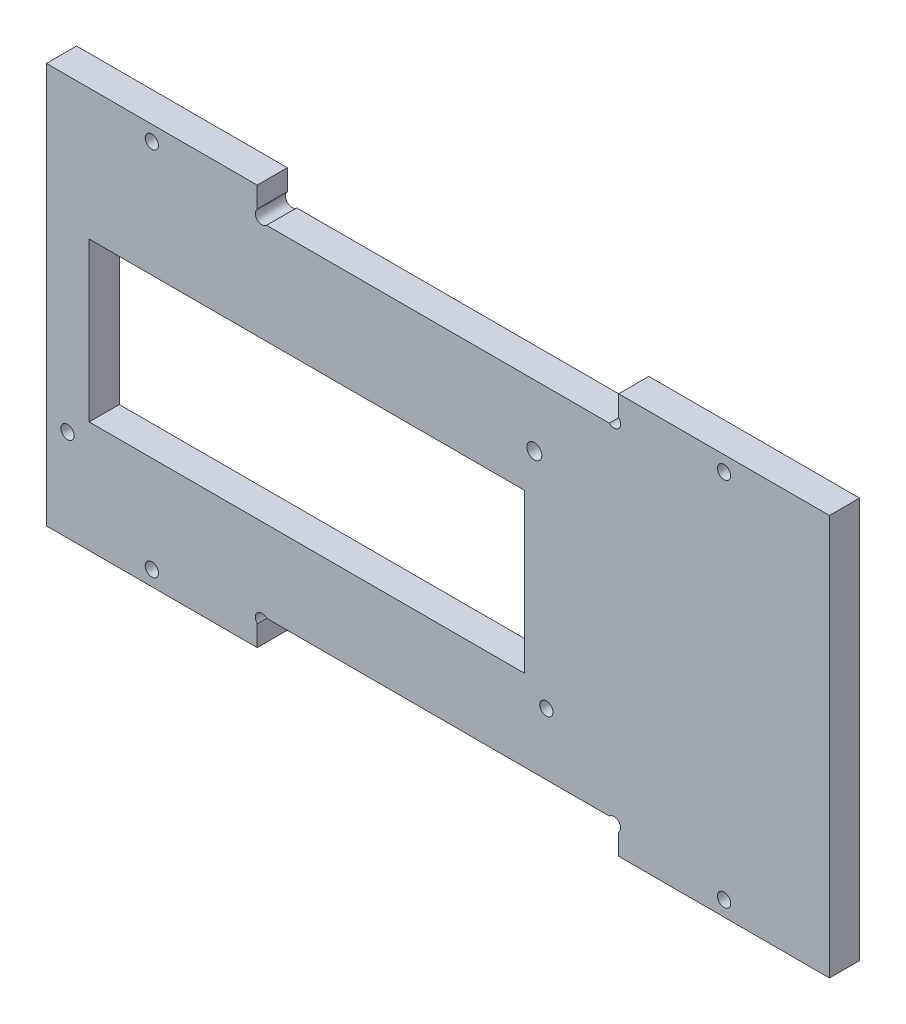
ISO-10303-21;
HEADER;
FILE_DESCRIPTION(('STEP AP214'),'2;1');
FILE_NAME('part.step','',(''),(''),'','','');
FILE_SCHEMA(('AUTOMOTIVE_DESIGN { 1 0 10303 214 1 1 1 1 }'));
ENDSEC;
DATA;
#1=APPLICATION_CONTEXT('core data for automotive mechanical design processes');
#2=APPLICATION_PROTOCOL_DEFINITION('international standard','automotive_design',2000,#1);
#3=PRODUCT_CONTEXT('',#1,'mechanical');
#4=PRODUCT('Part','Part','',(#3));
#5=PRODUCT_RELATED_PRODUCT_CATEGORY('part','',(#4));
#6=PRODUCT_DEFINITION_FORMATION('','',#4);
#7=PRODUCT_DEFINITION_CONTEXT('part definition',#1,'design');
#8=PRODUCT_DEFINITION('design','',#6,#7);
#9=PRODUCT_DEFINITION_SHAPE('','',#8);
#10=(LENGTH_UNIT() NAMED_UNIT(*) SI_UNIT(.MILLI.,.METRE.));
#11=(NAMED_UNIT(*) PLANE_ANGLE_UNIT() SI_UNIT($,.RADIAN.));
#12=(NAMED_UNIT(*) SI_UNIT($,.STERADIAN.) SOLID_ANGLE_UNIT());
#13=UNCERTAINTY_MEASURE_WITH_UNIT(LENGTH_MEASURE(1.E-05),#10,'distance_accuracy_value','');
#14=(GEOMETRIC_REPRESENTATION_CONTEXT(3) GLOBAL_UNCERTAINTY_ASSIGNED_CONTEXT((#13)) GLOBAL_UNIT_ASSIGNED_CONTEXT((#10,
#11,#12)) REPRESENTATION_CONTEXT('',''));
#15=CARTESIAN_POINT('',(0.,0.,0.));
#16=DIRECTION('',(0.,0.,1.));
#17=DIRECTION('',(1.,0.,0.));
#18=AXIS2_PLACEMENT_3D('',#15,#16,#17);
#19=CARTESIAN_POINT('',(0.,66.5,5.));
#20=DIRECTION('',(0.,0.,-1.));
#21=DIRECTION('',(-1.,0.,0.));
#22=AXIS2_PLACEMENT_3D('',#19,#20,#21);
#23=PLANE('',#22);
#24=CARTESIAN_POINT('',(112.5,2.5,5.));
#25=DIRECTION('',(0.,0.,-1.));
#26=DIRECTION('',(-1.,0.,0.));
#27=AXIS2_PLACEMENT_3D('',#24,#25,#26);
#28=CIRCLE('',#27,1.1);
#29=CARTESIAN_POINT('',(111.4,2.5,5.));
#30=VERTEX_POINT('',#29);
#31=EDGE_CURVE('E242',#30,#30,#28,.T.);
#32=ORIENTED_EDGE('',*,*,#31,.T.);
#33=EDGE_LOOP('',(#32));
#34=FACE_BOUND('',#33,.T.);
#35=CARTESIAN_POINT('',(17.5,2.5,5.));
#36=DIRECTION('',(0.,0.,1.));
#37=DIRECTION('',(1.,0.,0.));
#38=AXIS2_PLACEMENT_3D('',#35,#36,#37);
#39=CIRCLE('',#38,1.1);
#40=CARTESIAN_POINT('',(18.6,2.5,5.));
#41=VERTEX_POINT('',#40);
#42=EDGE_CURVE('E251',#41,#41,#39,.T.);
#43=ORIENTED_EDGE('',*,*,#42,.F.);
#44=EDGE_LOOP('',(#43));
#45=FACE_BOUND('',#44,.T.);
#46=DIRECTION('',(-1.,0.,0.));
#47=VECTOR('',#46,1.);
#48=CARTESIAN_POINT('',(79.4,44.8,5.));
#49=LINE('',#48,#47);
#50=CARTESIAN_POINT('',(79.4,44.8,5.));
#51=VERTEX_POINT('',#50);
#52=CARTESIAN_POINT('',(7.09999999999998,44.8,5.));
#53=VERTEX_POINT('',#52);
#54=EDGE_CURVE('E344',#51,#53,#49,.T.);
#55=ORIENTED_EDGE('',*,*,#54,.F.);
#56=DIRECTION('',(0.,1.,0.));
#57=VECTOR('',#56,1.);
#58=CARTESIAN_POINT('',(79.4,18.5,5.));
#59=LINE('',#58,#57);
#60=CARTESIAN_POINT('',(79.4,18.5,5.));
#61=VERTEX_POINT('',#60);
#62=EDGE_CURVE('E342',#61,#51,#59,.T.);
#63=ORIENTED_EDGE('',*,*,#62,.F.);
#64=DIRECTION('',(1.,0.,0.));
#65=VECTOR('',#64,1.);
#66=CARTESIAN_POINT('',(79.4,18.5,5.));
#67=LINE('',#66,#65);
#68=CARTESIAN_POINT('',(7.09999999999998,18.5,5.));
#69=VERTEX_POINT('',#68);
#70=EDGE_CURVE('E350',#69,#61,#67,.T.);
#71=ORIENTED_EDGE('',*,*,#70,.F.);
#72=DIRECTION('',(0.,-1.,0.));
#73=VECTOR('',#72,1.);
#74=CARTESIAN_POINT('',(7.09999999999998,18.5,5.));
#75=LINE('',#74,#73);
#76=EDGE_CURVE('E347',#53,#69,#75,.T.);
#77=ORIENTED_EDGE('',*,*,#76,.F.);
#78=EDGE_LOOP('',(#55,#63,#71,#77));
#79=FACE_BOUND('',#78,.T.);
#80=CARTESIAN_POINT('',(3.5,15.25,5.));
#81=DIRECTION('',(0.,0.,1.));
#82=DIRECTION('',(1.,0.,0.));
#83=AXIS2_PLACEMENT_3D('',#80,#81,#82);
#84=CIRCLE('',#83,1.1);
#85=CARTESIAN_POINT('',(4.6,15.25,5.));
#86=VERTEX_POINT('',#85);
#87=EDGE_CURVE('E366',#86,#86,#84,.T.);
#88=ORIENTED_EDGE('',*,*,#87,.F.);
#89=EDGE_LOOP('',(#88));
#90=FACE_BOUND('',#89,.T.);
#91=CARTESIAN_POINT('',(83.,15.25,5.));
#92=DIRECTION('',(0.,0.,1.));
#93=DIRECTION('',(1.,0.,0.));
#94=AXIS2_PLACEMENT_3D('',#91,#92,#93);
#95=CIRCLE('',#94,1.10000000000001);
#96=CARTESIAN_POINT('',(84.1,15.25,5.));
#97=VERTEX_POINT('',#96);
#98=EDGE_CURVE('E372',#97,#97,#95,.T.);
#99=ORIENTED_EDGE('',*,*,#98,.F.);
#100=EDGE_LOOP('',(#99));
#101=FACE_BOUND('',#100,.T.);
#102=CARTESIAN_POINT('',(81.,51.25,5.));
#103=DIRECTION('',(0.,0.,1.));
#104=DIRECTION('',(1.,0.,0.));
#105=AXIS2_PLACEMENT_3D('',#102,#103,#104);
#106=CIRCLE('',#105,1.25);
#107=CARTESIAN_POINT('',(82.25,51.25,5.));
#108=VERTEX_POINT('',#107);
#109=EDGE_CURVE('E378',#108,#108,#106,.T.);
#110=ORIENTED_EDGE('',*,*,#109,.F.);
#111=EDGE_LOOP('',(#110));
#112=FACE_BOUND('',#111,.T.);
#113=DIRECTION('',(0.,1.,0.));
#114=VECTOR('',#113,1.);
#115=CARTESIAN_POINT('',(95.,66.5,5.));
#116=LINE('',#115,#114);
#117=CARTESIAN_POINT('',(95.,63.0556349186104,5.));
#118=VERTEX_POINT('',#117);
#119=CARTESIAN_POINT('',(95.,66.5,5.));
#120=VERTEX_POINT('',#119);
#121=EDGE_CURVE('E300',#118,#120,#116,.T.);
#122=ORIENTED_EDGE('',*,*,#121,.F.);
#123=CARTESIAN_POINT('',(94.2221825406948,62.2778174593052,5.));
#124=DIRECTION('',(0.,0.,1.));
#125=DIRECTION('',(1.,0.,0.));
#126=AXIS2_PLACEMENT_3D('',#123,#124,#125);
#127=CIRCLE('',#126,1.10000000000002);
#128=CARTESIAN_POINT('',(93.4443650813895,61.5,5.));
#129=VERTEX_POINT('',#128);
#130=EDGE_CURVE('E271',#129,#118,#127,.T.);
#131=ORIENTED_EDGE('',*,*,#130,.F.);
#132=DIRECTION('',(1.,0.,0.));
#133=VECTOR('',#132,1.);
#134=CARTESIAN_POINT('',(95.,61.5,5.));
#135=LINE('',#134,#133);
#136=CARTESIAN_POINT('',(36.5556349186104,61.5,5.));
#137=VERTEX_POINT('',#136);
#138=EDGE_CURVE('E305',#137,#129,#135,.T.);
#139=ORIENTED_EDGE('',*,*,#138,.F.);
#140=CARTESIAN_POINT('',(35.7778174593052,62.2778174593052,5.));
#141=DIRECTION('',(0.,0.,1.));
#142=DIRECTION('',(1.,0.,0.));
#143=AXIS2_PLACEMENT_3D('',#140,#141,#142);
#144=CIRCLE('',#143,1.1);
#145=CARTESIAN_POINT('',(35.,63.0556349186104,5.));
#146=VERTEX_POINT('',#145);
#147=EDGE_CURVE('E277',#146,#137,#144,.T.);
#148=ORIENTED_EDGE('',*,*,#147,.F.);
#149=DIRECTION('',(0.,-1.,0.));
#150=VECTOR('',#149,1.);
#151=CARTESIAN_POINT('',(35.,66.5,5.));
#152=LINE('',#151,#150);
#153=CARTESIAN_POINT('',(35.,66.5,5.));
#154=VERTEX_POINT('',#153);
#155=EDGE_CURVE('E302',#154,#146,#152,.T.);
#156=ORIENTED_EDGE('',*,*,#155,.F.);
#157=DIRECTION('',(-1.,0.,0.));
#158=VECTOR('',#157,1.);
#159=CARTESIAN_POINT('',(0.,66.5,5.));
#160=LINE('',#159,#158);
#161=CARTESIAN_POINT('',(0.,66.5,5.));
#162=VERTEX_POINT('',#161);
#163=EDGE_CURVE('E394',#154,#162,#160,.T.);
#164=ORIENTED_EDGE('',*,*,#163,.T.);
#165=DIRECTION('',(0.,-1.,0.));
#166=VECTOR('',#165,1.);
#167=CARTESIAN_POINT('',(0.,0.,5.));
#168=LINE('',#167,#166);
#169=CARTESIAN_POINT('',(0.,0.,5.));
#170=VERTEX_POINT('',#169);
#171=EDGE_CURVE('E384',#162,#170,#168,.T.);
#172=ORIENTED_EDGE('',*,*,#171,.T.);
#173=DIRECTION('',(1.,0.,0.));
#174=VECTOR('',#173,1.);
#175=CARTESIAN_POINT('',(0.,0.,5.));
#176=LINE('',#175,#174);
#177=CARTESIAN_POINT('',(35.,0.,5.));
#178=VERTEX_POINT('',#177);
#179=EDGE_CURVE('E389',#170,#178,#176,.T.);
#180=ORIENTED_EDGE('',*,*,#179,.T.);
#181=DIRECTION('',(0.,-1.,0.));
#182=VECTOR('',#181,1.);
#183=CARTESIAN_POINT('',(35.,0.,5.));
#184=LINE('',#183,#182);
#185=CARTESIAN_POINT('',(35.,3.4443650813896,5.));
#186=VERTEX_POINT('',#185);
#187=EDGE_CURVE('E323',#186,#178,#184,.T.);
#188=ORIENTED_EDGE('',*,*,#187,.F.);
#189=CARTESIAN_POINT('',(35.7778174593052,4.2221825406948,5.));
#190=DIRECTION('',(0.,0.,1.));
#191=DIRECTION('',(1.,0.,0.));
#192=AXIS2_PLACEMENT_3D('',#189,#190,#191);
#193=CIRCLE('',#192,1.1);
#194=CARTESIAN_POINT('',(36.5556349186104,4.99999999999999,5.));
#195=VERTEX_POINT('',#194);
#196=EDGE_CURVE('E283',#195,#186,#193,.T.);
#197=ORIENTED_EDGE('',*,*,#196,.F.);
#198=DIRECTION('',(-1.,0.,0.));
#199=VECTOR('',#198,1.);
#200=CARTESIAN_POINT('',(95.,5.,5.));
#201=LINE('',#200,#199);
#202=CARTESIAN_POINT('',(93.4443650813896,5.,5.));
#203=VERTEX_POINT('',#202);
#204=EDGE_CURVE('E320',#203,#195,#201,.T.);
#205=ORIENTED_EDGE('',*,*,#204,.F.);
#206=CARTESIAN_POINT('',(94.2221825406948,4.2221825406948,5.));
#207=DIRECTION('',(0.,0.,1.));
#208=DIRECTION('',(1.,0.,0.));
#209=AXIS2_PLACEMENT_3D('',#206,#207,#208);
#210=CIRCLE('',#209,1.10000000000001);
#211=CARTESIAN_POINT('',(95.,3.44436508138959,5.));
#212=VERTEX_POINT('',#211);
#213=EDGE_CURVE('E289',#212,#203,#210,.T.);
#214=ORIENTED_EDGE('',*,*,#213,.F.);
#215=DIRECTION('',(0.,1.,0.));
#216=VECTOR('',#215,1.);
#217=CARTESIAN_POINT('',(95.,0.,5.));
#218=LINE('',#217,#216);
#219=CARTESIAN_POINT('',(95.,0.,5.));
#220=VERTEX_POINT('',#219);
#221=EDGE_CURVE('E317',#220,#212,#218,.T.);
#222=ORIENTED_EDGE('',*,*,#221,.F.);
#223=CARTESIAN_POINT('',(130.,0.,5.));
#224=VERTEX_POINT('',#223);
#225=EDGE_CURVE('E387',#220,#224,#176,.T.);
#226=ORIENTED_EDGE('',*,*,#225,.T.);
#227=DIRECTION('',(0.,1.,0.));
#228=VECTOR('',#227,1.);
#229=CARTESIAN_POINT('',(130.,0.,5.));
#230=LINE('',#229,#228);
#231=CARTESIAN_POINT('',(130.,66.5,5.));
#232=VERTEX_POINT('',#231);
#233=EDGE_CURVE('E392',#224,#232,#230,.T.);
#234=ORIENTED_EDGE('',*,*,#233,.T.);
#235=EDGE_CURVE('E395',#232,#120,#160,.T.);
#236=ORIENTED_EDGE('',*,*,#235,.T.);
#237=EDGE_LOOP('',(#122,#131,#139,#148,#156,#164,#172,#180,#188,#197,#205,#214,#222,#226,#234,#236));
#238=FACE_BOUND('',#237,.T.);
#239=CARTESIAN_POINT('',(112.5,64.,5.));
#240=DIRECTION('',(0.,0.,1.));
#241=DIRECTION('',(-1.,0.,0.));
#242=AXIS2_PLACEMENT_3D('',#239,#240,#241);
#243=CIRCLE('',#242,1.1);
#244=CARTESIAN_POINT('',(111.4,64.,5.));
#245=VERTEX_POINT('',#244);
#246=EDGE_CURVE('E239',#245,#245,#243,.T.);
#247=ORIENTED_EDGE('',*,*,#246,.F.);
#248=EDGE_LOOP('',(#247));
#249=FACE_BOUND('',#248,.T.);
#250=CARTESIAN_POINT('',(17.5,64.,5.));
#251=DIRECTION('',(0.,0.,-1.));
#252=DIRECTION('',(1.,0.,0.));
#253=AXIS2_PLACEMENT_3D('',#250,#251,#252);
#254=CIRCLE('',#253,1.1);
#255=CARTESIAN_POINT('',(18.6,64.,5.));
#256=VERTEX_POINT('',#255);
#257=EDGE_CURVE('E229',#256,#256,#254,.T.);
#258=ORIENTED_EDGE('',*,*,#257,.T.);
#259=EDGE_LOOP('',(#258));
#260=FACE_BOUND('',#259,.T.);
#261=ADVANCED_FACE('F33',(#34,#45,#79,#90,#101,#112,#238,#249,#260),#23,.F.);
#262=CARTESIAN_POINT('',(0.,66.5,0.));
#263=DIRECTION('',(0.,0.,-1.));
#264=DIRECTION('',(-1.,0.,0.));
#265=AXIS2_PLACEMENT_3D('',#262,#263,#264);
#266=PLANE('',#265);
#267=DIRECTION('',(0.,-1.,0.));
#268=VECTOR('',#267,1.);
#269=CARTESIAN_POINT('',(78.4,48.3,0.));
#270=LINE('',#269,#268);
#271=CARTESIAN_POINT('',(78.4,54.8,0.));
#272=VERTEX_POINT('',#271);
#273=CARTESIAN_POINT('',(78.4,48.3,0.));
#274=VERTEX_POINT('',#273);
#275=EDGE_CURVE('E48',#272,#274,#270,.T.);
#276=ORIENTED_EDGE('',*,*,#275,.F.);
#277=DIRECTION('',(1.,0.,0.));
#278=VECTOR('',#277,1.);
#279=CARTESIAN_POINT('',(78.4,54.8,0.));
#280=LINE('',#279,#278);
#281=CARTESIAN_POINT('',(38.4,54.8,0.));
#282=VERTEX_POINT('',#281);
#283=EDGE_CURVE('E214',#282,#272,#280,.T.);
#284=ORIENTED_EDGE('',*,*,#283,.F.);
#285=DIRECTION('',(0.,1.,0.));
#286=VECTOR('',#285,1.);
#287=CARTESIAN_POINT('',(38.4,48.3,0.));
#288=LINE('',#287,#286);
#289=CARTESIAN_POINT('',(38.4,48.3,0.));
#290=VERTEX_POINT('',#289);
#291=EDGE_CURVE('E217',#290,#282,#288,.T.);
#292=ORIENTED_EDGE('',*,*,#291,.F.);
#293=DIRECTION('',(-1.,0.,0.));
#294=VECTOR('',#293,1.);
#295=CARTESIAN_POINT('',(78.4,48.3,0.));
#296=LINE('',#295,#294);
#297=EDGE_CURVE('E223',#274,#290,#296,.T.);
#298=ORIENTED_EDGE('',*,*,#297,.F.);
#299=EDGE_LOOP('',(#276,#284,#292,#298));
#300=FACE_BOUND('',#299,.T.);
#301=CARTESIAN_POINT('',(112.5,2.5,0.));
#302=DIRECTION('',(0.,0.,-1.));
#303=DIRECTION('',(-1.,0.,0.));
#304=AXIS2_PLACEMENT_3D('',#301,#302,#303);
#305=CIRCLE('',#304,1.1);
#306=CARTESIAN_POINT('',(111.4,2.5,0.));
#307=VERTEX_POINT('',#306);
#308=EDGE_CURVE('E247',#307,#307,#305,.T.);
#309=ORIENTED_EDGE('',*,*,#308,.F.);
#310=EDGE_LOOP('',(#309));
#311=FACE_BOUND('',#310,.T.);
#312=CARTESIAN_POINT('',(17.5,2.5,0.));
#313=DIRECTION('',(0.,0.,-1.));
#314=DIRECTION('',(-1.,0.,0.));
#315=AXIS2_PLACEMENT_3D('',#312,#313,#314);
#316=CIRCLE('',#315,1.1);
#317=CARTESIAN_POINT('',(16.4,2.5,0.));
#318=VERTEX_POINT('',#317);
#319=EDGE_CURVE('E250',#318,#318,#316,.F.);
#320=ORIENTED_EDGE('',*,*,#319,.T.);
#321=EDGE_LOOP('',(#320));
#322=FACE_BOUND('',#321,.T.);
#323=CARTESIAN_POINT('',(94.2221825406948,62.2778174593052,0.));
#324=DIRECTION('',(0.,0.,-1.));
#325=DIRECTION('',(-1.,0.,0.));
#326=AXIS2_PLACEMENT_3D('',#323,#324,#325);
#327=CIRCLE('',#326,1.10000000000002);
#328=CARTESIAN_POINT('',(93.4443650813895,61.5,0.));
#329=VERTEX_POINT('',#328);
#330=CARTESIAN_POINT('',(95.,63.0556349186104,0.));
#331=VERTEX_POINT('',#330);
#332=EDGE_CURVE('E273',#329,#331,#327,.F.);
#333=ORIENTED_EDGE('',*,*,#332,.T.);
#334=DIRECTION('',(0.,1.,0.));
#335=VECTOR('',#334,1.);
#336=CARTESIAN_POINT('',(95.,66.5,0.));
#337=LINE('',#336,#335);
#338=CARTESIAN_POINT('',(95.,66.5,0.));
#339=VERTEX_POINT('',#338);
#340=EDGE_CURVE('E298',#331,#339,#337,.T.);
#341=ORIENTED_EDGE('',*,*,#340,.T.);
#342=DIRECTION('',(-1.,0.,0.));
#343=VECTOR('',#342,1.);
#344=CARTESIAN_POINT('',(0.,66.5,0.));
#345=LINE('',#344,#343);
#346=CARTESIAN_POINT('',(130.,66.5,0.));
#347=VERTEX_POINT('',#346);
#348=EDGE_CURVE('E388',#347,#339,#345,.T.);
#349=ORIENTED_EDGE('',*,*,#348,.F.);
#350=DIRECTION('',(0.,1.,0.));
#351=VECTOR('',#350,1.);
#352=CARTESIAN_POINT('',(130.,0.,0.));
#353=LINE('',#352,#351);
#354=CARTESIAN_POINT('',(130.,0.,0.));
#355=VERTEX_POINT('',#354);
#356=EDGE_CURVE('E405',#355,#347,#353,.T.);
#357=ORIENTED_EDGE('',*,*,#356,.F.);
#358=DIRECTION('',(1.,0.,0.));
#359=VECTOR('',#358,1.);
#360=CARTESIAN_POINT('',(0.,0.,0.));
#361=LINE('',#360,#359);
#362=CARTESIAN_POINT('',(95.,0.,0.));
#363=VERTEX_POINT('',#362);
#364=EDGE_CURVE('E401',#363,#355,#361,.T.);
#365=ORIENTED_EDGE('',*,*,#364,.F.);
#366=DIRECTION('',(0.,1.,0.));
#367=VECTOR('',#366,1.);
#368=CARTESIAN_POINT('',(95.,0.,0.));
#369=LINE('',#368,#367);
#370=CARTESIAN_POINT('',(95.,3.44436508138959,0.));
#371=VERTEX_POINT('',#370);
#372=EDGE_CURVE('E314',#363,#371,#369,.T.);
#373=ORIENTED_EDGE('',*,*,#372,.T.);
#374=CARTESIAN_POINT('',(94.2221825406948,4.2221825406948,0.));
#375=DIRECTION('',(0.,0.,-1.));
#376=DIRECTION('',(-1.,0.,0.));
#377=AXIS2_PLACEMENT_3D('',#374,#375,#376);
#378=CIRCLE('',#377,1.10000000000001);
#379=CARTESIAN_POINT('',(93.4443650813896,5.,0.));
#380=VERTEX_POINT('',#379);
#381=EDGE_CURVE('E291',#371,#380,#378,.F.);
#382=ORIENTED_EDGE('',*,*,#381,.T.);
#383=DIRECTION('',(-1.,0.,0.));
#384=VECTOR('',#383,1.);
#385=CARTESIAN_POINT('',(95.,5.,0.));
#386=LINE('',#385,#384);
#387=CARTESIAN_POINT('',(36.5556349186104,4.99999999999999,0.));
#388=VERTEX_POINT('',#387);
#389=EDGE_CURVE('E328',#380,#388,#386,.T.);
#390=ORIENTED_EDGE('',*,*,#389,.T.);
#391=CARTESIAN_POINT('',(35.7778174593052,4.2221825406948,0.));
#392=DIRECTION('',(0.,0.,-1.));
#393=DIRECTION('',(-1.,0.,0.));
#394=AXIS2_PLACEMENT_3D('',#391,#392,#393);
#395=CIRCLE('',#394,1.1);
#396=CARTESIAN_POINT('',(35.,3.4443650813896,0.));
#397=VERTEX_POINT('',#396);
#398=EDGE_CURVE('E285',#388,#397,#395,.F.);
#399=ORIENTED_EDGE('',*,*,#398,.T.);
#400=DIRECTION('',(0.,-1.,0.));
#401=VECTOR('',#400,1.);
#402=CARTESIAN_POINT('',(35.,0.,0.));
#403=LINE('',#402,#401);
#404=CARTESIAN_POINT('',(35.,0.,0.));
#405=VERTEX_POINT('',#404);
#406=EDGE_CURVE('E310',#397,#405,#403,.T.);
#407=ORIENTED_EDGE('',*,*,#406,.T.);
#408=CARTESIAN_POINT('',(0.,0.,0.));
#409=VERTEX_POINT('',#408);
#410=EDGE_CURVE('E402',#409,#405,#361,.T.);
#411=ORIENTED_EDGE('',*,*,#410,.F.);
#412=DIRECTION('',(0.,-1.,0.));
#413=VECTOR('',#412,1.);
#414=CARTESIAN_POINT('',(0.,0.,0.));
#415=LINE('',#414,#413);
#416=CARTESIAN_POINT('',(0.,66.5,0.));
#417=VERTEX_POINT('',#416);
#418=EDGE_CURVE('E381',#417,#409,#415,.T.);
#419=ORIENTED_EDGE('',*,*,#418,.F.);
#420=CARTESIAN_POINT('',(35.,66.5,0.));
#421=VERTEX_POINT('',#420);
#422=EDGE_CURVE('E407',#421,#417,#345,.T.);
#423=ORIENTED_EDGE('',*,*,#422,.F.);
#424=DIRECTION('',(0.,-1.,0.));
#425=VECTOR('',#424,1.);
#426=CARTESIAN_POINT('',(35.,66.5,0.));
#427=LINE('',#426,#425);
#428=CARTESIAN_POINT('',(35.,63.0556349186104,0.));
#429=VERTEX_POINT('',#428);
#430=EDGE_CURVE('E294',#421,#429,#427,.T.);
#431=ORIENTED_EDGE('',*,*,#430,.T.);
#432=CARTESIAN_POINT('',(35.7778174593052,62.2778174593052,0.));
#433=DIRECTION('',(0.,0.,-1.));
#434=DIRECTION('',(-1.,0.,0.));
#435=AXIS2_PLACEMENT_3D('',#432,#433,#434);
#436=CIRCLE('',#435,1.1);
#437=CARTESIAN_POINT('',(36.5556349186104,61.5,0.));
#438=VERTEX_POINT('',#437);
#439=EDGE_CURVE('E279',#429,#438,#436,.F.);
#440=ORIENTED_EDGE('',*,*,#439,.T.);
#441=DIRECTION('',(1.,0.,0.));
#442=VECTOR('',#441,1.);
#443=CARTESIAN_POINT('',(95.,61.5,0.));
#444=LINE('',#443,#442);
#445=EDGE_CURVE('E56',#438,#329,#444,.T.);
#446=ORIENTED_EDGE('',*,*,#445,.T.);
#447=EDGE_LOOP('',(#333,#341,#349,#357,#365,#373,#382,#390,#399,#407,#411,#419,#423,#431,#440,#446));
#448=FACE_BOUND('',#447,.T.);
#449=DIRECTION('',(0.,1.,0.));
#450=VECTOR('',#449,1.);
#451=CARTESIAN_POINT('',(79.4,18.5,0.));
#452=LINE('',#451,#450);
#453=CARTESIAN_POINT('',(79.4,18.5,0.));
#454=VERTEX_POINT('',#453);
#455=CARTESIAN_POINT('',(79.4,44.8,0.));
#456=VERTEX_POINT('',#455);
#457=EDGE_CURVE('E339',#454,#456,#452,.T.);
#458=ORIENTED_EDGE('',*,*,#457,.T.);
#459=DIRECTION('',(-1.,0.,0.));
#460=VECTOR('',#459,1.);
#461=CARTESIAN_POINT('',(79.4,44.8,0.));
#462=LINE('',#461,#460);
#463=CARTESIAN_POINT('',(7.09999999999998,44.8,0.));
#464=VERTEX_POINT('',#463);
#465=EDGE_CURVE('E356',#456,#464,#462,.T.);
#466=ORIENTED_EDGE('',*,*,#465,.T.);
#467=DIRECTION('',(0.,-1.,0.));
#468=VECTOR('',#467,1.);
#469=CARTESIAN_POINT('',(7.09999999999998,18.5,0.));
#470=LINE('',#469,#468);
#471=CARTESIAN_POINT('',(7.09999999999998,18.5,0.));
#472=VERTEX_POINT('',#471);
#473=EDGE_CURVE('E333',#464,#472,#470,.T.);
#474=ORIENTED_EDGE('',*,*,#473,.T.);
#475=DIRECTION('',(1.,0.,0.));
#476=VECTOR('',#475,1.);
#477=CARTESIAN_POINT('',(79.4,18.5,0.));
#478=LINE('',#477,#476);
#479=EDGE_CURVE('E336',#472,#454,#478,.T.);
#480=ORIENTED_EDGE('',*,*,#479,.T.);
#481=EDGE_LOOP('',(#458,#466,#474,#480));
#482=FACE_BOUND('',#481,.T.);
#483=CARTESIAN_POINT('',(3.5,15.25,0.));
#484=DIRECTION('',(0.,0.,-1.));
#485=DIRECTION('',(-1.,0.,0.));
#486=AXIS2_PLACEMENT_3D('',#483,#484,#485);
#487=CIRCLE('',#486,1.1);
#488=CARTESIAN_POINT('',(2.4,15.25,0.));
#489=VERTEX_POINT('',#488);
#490=EDGE_CURVE('E365',#489,#489,#487,.F.);
#491=ORIENTED_EDGE('',*,*,#490,.T.);
#492=EDGE_LOOP('',(#491));
#493=FACE_BOUND('',#492,.T.);
#494=CARTESIAN_POINT('',(83.,15.25,0.));
#495=DIRECTION('',(0.,0.,-1.));
#496=DIRECTION('',(-1.,0.,0.));
#497=AXIS2_PLACEMENT_3D('',#494,#495,#496);
#498=CIRCLE('',#497,1.10000000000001);
#499=CARTESIAN_POINT('',(81.9,15.25,0.));
#500=VERTEX_POINT('',#499);
#501=EDGE_CURVE('E369',#500,#500,#498,.F.);
#502=ORIENTED_EDGE('',*,*,#501,.T.);
#503=EDGE_LOOP('',(#502));
#504=FACE_BOUND('',#503,.T.);
#505=CARTESIAN_POINT('',(81.,51.25,0.));
#506=DIRECTION('',(0.,0.,-1.));
#507=DIRECTION('',(-1.,0.,0.));
#508=AXIS2_PLACEMENT_3D('',#505,#506,#507);
#509=CIRCLE('',#508,1.25);
#510=CARTESIAN_POINT('',(79.75,51.25,0.));
#511=VERTEX_POINT('',#510);
#512=EDGE_CURVE('E375',#511,#511,#509,.F.);
#513=ORIENTED_EDGE('',*,*,#512,.T.);
#514=EDGE_LOOP('',(#513));
#515=FACE_BOUND('',#514,.T.);
#516=CARTESIAN_POINT('',(112.5,64.,0.));
#517=DIRECTION('',(0.,0.,-1.));
#518=DIRECTION('',(-1.,0.,0.));
#519=AXIS2_PLACEMENT_3D('',#516,#517,#518);
#520=CIRCLE('',#519,1.1);
#521=CARTESIAN_POINT('',(111.4,64.,0.));
#522=VERTEX_POINT('',#521);
#523=EDGE_CURVE('E238',#522,#522,#520,.F.);
#524=ORIENTED_EDGE('',*,*,#523,.T.);
#525=EDGE_LOOP('',(#524));
#526=FACE_BOUND('',#525,.T.);
#527=CARTESIAN_POINT('',(17.5,64.,0.));
#528=DIRECTION('',(0.,0.,-1.));
#529=DIRECTION('',(-1.,0.,0.));
#530=AXIS2_PLACEMENT_3D('',#527,#528,#529);
#531=CIRCLE('',#530,1.1);
#532=CARTESIAN_POINT('',(16.4,64.,0.));
#533=VERTEX_POINT('',#532);
#534=EDGE_CURVE('E235',#533,#533,#531,.T.);
#535=ORIENTED_EDGE('',*,*,#534,.F.);
#536=EDGE_LOOP('',(#535));
#537=FACE_BOUND('',#536,.T.);
#538=ADVANCED_FACE('F425',(#300,#311,#322,#448,#482,#493,#504,#515,#526,#537),#266,.T.);
#539=CARTESIAN_POINT('',(0.,66.5,5.));
#540=DIRECTION('',(0.,-1.,0.));
#541=DIRECTION('',(0.,0.,-1.));
#542=AXIS2_PLACEMENT_3D('',#539,#540,#541);
#543=PLANE('',#542);
#544=ORIENTED_EDGE('',*,*,#348,.T.);
#545=DIRECTION('',(0.,0.,1.));
#546=VECTOR('',#545,1.);
#547=CARTESIAN_POINT('',(95.,66.5,-0.00100000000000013));
#548=LINE('',#547,#546);
#549=EDGE_CURVE('E307',#339,#120,#548,.T.);
#550=ORIENTED_EDGE('',*,*,#549,.T.);
#551=ORIENTED_EDGE('',*,*,#235,.F.);
#552=DIRECTION('',(0.,0.,-1.));
#553=VECTOR('',#552,1.);
#554=CARTESIAN_POINT('',(130.,66.5,5.));
#555=LINE('',#554,#553);
#556=EDGE_CURVE('E412',#232,#347,#555,.T.);
#557=ORIENTED_EDGE('',*,*,#556,.T.);
#558=EDGE_LOOP('',(#544,#550,#551,#557));
#559=FACE_BOUND('',#558,.T.);
#560=ADVANCED_FACE('F430',(#559),#543,.F.);
#561=CARTESIAN_POINT('',(0.,0.,5.));
#562=DIRECTION('',(0.,1.,0.));
#563=DIRECTION('',(0.,0.,1.));
#564=AXIS2_PLACEMENT_3D('',#561,#562,#563);
#565=PLANE('',#564);
#566=ORIENTED_EDGE('',*,*,#225,.F.);
#567=DIRECTION('',(0.,0.,1.));
#568=VECTOR('',#567,1.);
#569=CARTESIAN_POINT('',(95.,0.,-0.00100000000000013));
#570=LINE('',#569,#568);
#571=EDGE_CURVE('E326',#363,#220,#570,.T.);
#572=ORIENTED_EDGE('',*,*,#571,.F.);
#573=ORIENTED_EDGE('',*,*,#364,.T.);
#574=DIRECTION('',(0.,0.,-1.));
#575=VECTOR('',#574,1.);
#576=CARTESIAN_POINT('',(130.,0.,5.));
#577=LINE('',#576,#575);
#578=EDGE_CURVE('E41',#224,#355,#577,.T.);
#579=ORIENTED_EDGE('',*,*,#578,.F.);
#580=EDGE_LOOP('',(#566,#572,#573,#579));
#581=FACE_BOUND('',#580,.T.);
#582=ADVANCED_FACE('F438',(#581),#565,.F.);
#583=CARTESIAN_POINT('',(0.,0.,5.));
#584=DIRECTION('',(1.,0.,0.));
#585=DIRECTION('',(0.,0.,-1.));
#586=AXIS2_PLACEMENT_3D('',#583,#584,#585);
#587=PLANE('',#586);
#588=ORIENTED_EDGE('',*,*,#418,.T.);
#589=DIRECTION('',(0.,0.,-1.));
#590=VECTOR('',#589,1.);
#591=CARTESIAN_POINT('',(0.,0.,5.));
#592=LINE('',#591,#590);
#593=EDGE_CURVE('E11',#170,#409,#592,.T.);
#594=ORIENTED_EDGE('',*,*,#593,.F.);
#595=ORIENTED_EDGE('',*,*,#171,.F.);
#596=DIRECTION('',(0.,0.,-1.));
#597=VECTOR('',#596,1.);
#598=CARTESIAN_POINT('',(0.,66.5,5.));
#599=LINE('',#598,#597);
#600=EDGE_CURVE('E398',#162,#417,#599,.T.);
#601=ORIENTED_EDGE('',*,*,#600,.T.);
#602=EDGE_LOOP('',(#588,#594,#595,#601));
#603=FACE_BOUND('',#602,.T.);
#604=ADVANCED_FACE('F35',(#603),#587,.F.);
#605=ORIENTED_EDGE('',*,*,#410,.T.);
#606=DIRECTION('',(0.,0.,1.));
#607=VECTOR('',#606,1.);
#608=CARTESIAN_POINT('',(35.,0.,-0.00100000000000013));
#609=LINE('',#608,#607);
#610=EDGE_CURVE('E325',#405,#178,#609,.T.);
#611=ORIENTED_EDGE('',*,*,#610,.T.);
#612=ORIENTED_EDGE('',*,*,#179,.F.);
#613=ORIENTED_EDGE('',*,*,#593,.T.);
#614=EDGE_LOOP('',(#605,#611,#612,#613));
#615=FACE_BOUND('',#614,.T.);
#616=ADVANCED_FACE('F459',(#615),#565,.F.);
#617=CARTESIAN_POINT('',(130.,0.,5.));
#618=DIRECTION('',(-1.,0.,0.));
#619=DIRECTION('',(0.,0.,1.));
#620=AXIS2_PLACEMENT_3D('',#617,#618,#619);
#621=PLANE('',#620);
#622=ORIENTED_EDGE('',*,*,#356,.T.);
#623=ORIENTED_EDGE('',*,*,#556,.F.);
#624=ORIENTED_EDGE('',*,*,#233,.F.);
#625=ORIENTED_EDGE('',*,*,#578,.T.);
#626=EDGE_LOOP('',(#622,#623,#624,#625));
#627=FACE_BOUND('',#626,.T.);
#628=ADVANCED_FACE('F419',(#627),#621,.F.);
#629=ORIENTED_EDGE('',*,*,#163,.F.);
#630=DIRECTION('',(0.,0.,1.));
#631=VECTOR('',#630,1.);
#632=CARTESIAN_POINT('',(35.,66.5,-0.00100000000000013));
#633=LINE('',#632,#631);
#634=EDGE_CURVE('E308',#421,#154,#633,.T.);
#635=ORIENTED_EDGE('',*,*,#634,.F.);
#636=ORIENTED_EDGE('',*,*,#422,.T.);
#637=ORIENTED_EDGE('',*,*,#600,.F.);
#638=EDGE_LOOP('',(#629,#635,#636,#637));
#639=FACE_BOUND('',#638,.T.);
#640=ADVANCED_FACE('F468',(#639),#543,.F.);
#641=CARTESIAN_POINT('',(81.,51.25,-0.00100000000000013));
#642=DIRECTION('',(0.,0.,1.));
#643=DIRECTION('',(1.,0.,0.));
#644=AXIS2_PLACEMENT_3D('',#641,#642,#643);
#645=CYLINDRICAL_SURFACE('',#644,1.25);
#646=ORIENTED_EDGE('',*,*,#512,.F.);
#647=EDGE_LOOP('',(#646));
#648=FACE_BOUND('',#647,.T.);
#649=ORIENTED_EDGE('',*,*,#109,.T.);
#650=EDGE_LOOP('',(#649));
#651=FACE_BOUND('',#650,.T.);
#652=ADVANCED_FACE('F509',(#648,#651),#645,.F.);
#653=CARTESIAN_POINT('',(83.,15.25,-0.00100000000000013));
#654=DIRECTION('',(0.,0.,1.));
#655=DIRECTION('',(1.,0.,0.));
#656=AXIS2_PLACEMENT_3D('',#653,#654,#655);
#657=CYLINDRICAL_SURFACE('',#656,1.10000000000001);
#658=ORIENTED_EDGE('',*,*,#501,.F.);
#659=EDGE_LOOP('',(#658));
#660=FACE_BOUND('',#659,.T.);
#661=ORIENTED_EDGE('',*,*,#98,.T.);
#662=EDGE_LOOP('',(#661));
#663=FACE_BOUND('',#662,.T.);
#664=ADVANCED_FACE('F576',(#660,#663),#657,.F.);
#665=CARTESIAN_POINT('',(3.5,15.25,-0.00100000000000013));
#666=DIRECTION('',(0.,0.,1.));
#667=DIRECTION('',(1.,0.,0.));
#668=AXIS2_PLACEMENT_3D('',#665,#666,#667);
#669=CYLINDRICAL_SURFACE('',#668,1.1);
#670=ORIENTED_EDGE('',*,*,#490,.F.);
#671=EDGE_LOOP('',(#670));
#672=FACE_BOUND('',#671,.T.);
#673=ORIENTED_EDGE('',*,*,#87,.T.);
#674=EDGE_LOOP('',(#673));
#675=FACE_BOUND('',#674,.T.);
#676=ADVANCED_FACE('F566',(#672,#675),#669,.F.);
#677=CARTESIAN_POINT('',(79.4,18.5,-0.00100000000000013));
#678=DIRECTION('',(1.,0.,0.));
#679=DIRECTION('',(0.,0.,-1.));
#680=AXIS2_PLACEMENT_3D('',#677,#678,#679);
#681=PLANE('',#680);
#682=DIRECTION('',(0.,0.,1.));
#683=VECTOR('',#682,1.);
#684=CARTESIAN_POINT('',(79.4,18.5,-0.00100000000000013));
#685=LINE('',#684,#683);
#686=EDGE_CURVE('E354',#454,#61,#685,.T.);
#687=ORIENTED_EDGE('',*,*,#686,.T.);
#688=ORIENTED_EDGE('',*,*,#62,.T.);
#689=DIRECTION('',(0.,0.,1.));
#690=VECTOR('',#689,1.);
#691=CARTESIAN_POINT('',(79.4,44.8,-0.00100000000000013));
#692=LINE('',#691,#690);
#693=EDGE_CURVE('E353',#456,#51,#692,.T.);
#694=ORIENTED_EDGE('',*,*,#693,.F.);
#695=ORIENTED_EDGE('',*,*,#457,.F.);
#696=EDGE_LOOP('',(#687,#688,#694,#695));
#697=FACE_BOUND('',#696,.T.);
#698=ADVANCED_FACE('F556',(#697),#681,.F.);
#699=CARTESIAN_POINT('',(79.4,18.5,-0.00100000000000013));
#700=DIRECTION('',(0.,-1.,0.));
#701=DIRECTION('',(1.,0.,0.));
#702=AXIS2_PLACEMENT_3D('',#699,#700,#701);
#703=PLANE('',#702);
#704=DIRECTION('',(0.,0.,1.));
#705=VECTOR('',#704,1.);
#706=CARTESIAN_POINT('',(7.09999999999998,18.5,-0.00100000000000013));
#707=LINE('',#706,#705);
#708=EDGE_CURVE('E357',#472,#69,#707,.T.);
#709=ORIENTED_EDGE('',*,*,#708,.T.);
#710=ORIENTED_EDGE('',*,*,#70,.T.);
#711=ORIENTED_EDGE('',*,*,#686,.F.);
#712=ORIENTED_EDGE('',*,*,#479,.F.);
#713=EDGE_LOOP('',(#709,#710,#711,#712));
#714=FACE_BOUND('',#713,.T.);
#715=ADVANCED_FACE('F546',(#714),#703,.F.);
#716=CARTESIAN_POINT('',(7.09999999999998,18.5,-0.00100000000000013));
#717=DIRECTION('',(-1.,0.,0.));
#718=DIRECTION('',(0.,-1.,0.));
#719=AXIS2_PLACEMENT_3D('',#716,#717,#718);
#720=PLANE('',#719);
#721=DIRECTION('',(0.,0.,1.));
#722=VECTOR('',#721,1.);
#723=CARTESIAN_POINT('',(7.09999999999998,44.8,-0.00100000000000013));
#724=LINE('',#723,#722);
#725=EDGE_CURVE('E359',#464,#53,#724,.T.);
#726=ORIENTED_EDGE('',*,*,#725,.T.);
#727=ORIENTED_EDGE('',*,*,#76,.T.);
#728=ORIENTED_EDGE('',*,*,#708,.F.);
#729=ORIENTED_EDGE('',*,*,#473,.F.);
#730=EDGE_LOOP('',(#726,#727,#728,#729));
#731=FACE_BOUND('',#730,.T.);
#732=ADVANCED_FACE('F535',(#731),#720,.F.);
#733=CARTESIAN_POINT('',(79.4,44.8,-0.00100000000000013));
#734=DIRECTION('',(0.,1.,0.));
#735=DIRECTION('',(-1.,0.,0.));
#736=AXIS2_PLACEMENT_3D('',#733,#734,#735);
#737=PLANE('',#736);
#738=ORIENTED_EDGE('',*,*,#693,.T.);
#739=ORIENTED_EDGE('',*,*,#54,.T.);
#740=ORIENTED_EDGE('',*,*,#725,.F.);
#741=ORIENTED_EDGE('',*,*,#465,.F.);
#742=EDGE_LOOP('',(#738,#739,#740,#741));
#743=FACE_BOUND('',#742,.T.);
#744=ADVANCED_FACE('F530',(#743),#737,.F.);
#745=CARTESIAN_POINT('',(95.,0.,-0.00100000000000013));
#746=DIRECTION('',(1.,0.,0.));
#747=DIRECTION('',(0.,0.,-1.));
#748=AXIS2_PLACEMENT_3D('',#745,#746,#747);
#749=PLANE('',#748);
#750=ORIENTED_EDGE('',*,*,#221,.T.);
#751=DIRECTION('',(0.,0.,1.));
#752=VECTOR('',#751,1.);
#753=CARTESIAN_POINT('',(95.,3.44436508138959,-0.00100000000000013));
#754=LINE('',#753,#752);
#755=EDGE_CURVE('E265',#371,#212,#754,.T.);
#756=ORIENTED_EDGE('',*,*,#755,.F.);
#757=ORIENTED_EDGE('',*,*,#372,.F.);
#758=ORIENTED_EDGE('',*,*,#571,.T.);
#759=EDGE_LOOP('',(#750,#756,#757,#758));
#760=FACE_BOUND('',#759,.T.);
#761=ADVANCED_FACE('F440',(#760),#749,.F.);
#762=CARTESIAN_POINT('',(35.,0.,-0.00100000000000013));
#763=DIRECTION('',(-1.,0.,0.));
#764=DIRECTION('',(0.,0.,1.));
#765=AXIS2_PLACEMENT_3D('',#762,#763,#764);
#766=PLANE('',#765);
#767=ORIENTED_EDGE('',*,*,#406,.F.);
#768=DIRECTION('',(0.,0.,1.));
#769=VECTOR('',#768,1.);
#770=CARTESIAN_POINT('',(35.,3.4443650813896,-0.00100000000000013));
#771=LINE('',#770,#769);
#772=EDGE_CURVE('E262',#186,#397,#771,.F.);
#773=ORIENTED_EDGE('',*,*,#772,.F.);
#774=ORIENTED_EDGE('',*,*,#187,.T.);
#775=ORIENTED_EDGE('',*,*,#610,.F.);
#776=EDGE_LOOP('',(#767,#773,#774,#775));
#777=FACE_BOUND('',#776,.T.);
#778=ADVANCED_FACE('F457',(#777),#766,.F.);
#779=CARTESIAN_POINT('',(95.,5.,-0.00100000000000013));
#780=DIRECTION('',(0.,1.,0.));
#781=DIRECTION('',(-1.,0.,0.));
#782=AXIS2_PLACEMENT_3D('',#779,#780,#781);
#783=PLANE('',#782);
#784=ORIENTED_EDGE('',*,*,#204,.T.);
#785=DIRECTION('',(0.,0.,1.));
#786=VECTOR('',#785,1.);
#787=CARTESIAN_POINT('',(36.5556349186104,4.99999999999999,-0.00100000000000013));
#788=LINE('',#787,#786);
#789=EDGE_CURVE('E281',#388,#195,#788,.T.);
#790=ORIENTED_EDGE('',*,*,#789,.F.);
#791=ORIENTED_EDGE('',*,*,#389,.F.);
#792=DIRECTION('',(0.,0.,1.));
#793=VECTOR('',#792,1.);
#794=CARTESIAN_POINT('',(93.4443650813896,5.,-0.00100000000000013));
#795=LINE('',#794,#793);
#796=EDGE_CURVE('E287',#203,#380,#795,.F.);
#797=ORIENTED_EDGE('',*,*,#796,.F.);
#798=EDGE_LOOP('',(#784,#790,#791,#797));
#799=FACE_BOUND('',#798,.T.);
#800=ADVANCED_FACE('F447',(#799),#783,.F.);
#801=CARTESIAN_POINT('',(95.,66.5,-0.00100000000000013));
#802=DIRECTION('',(1.,0.,0.));
#803=DIRECTION('',(0.,0.,-1.));
#804=AXIS2_PLACEMENT_3D('',#801,#802,#803);
#805=PLANE('',#804);
#806=ORIENTED_EDGE('',*,*,#340,.F.);
#807=DIRECTION('',(0.,0.,1.));
#808=VECTOR('',#807,1.);
#809=CARTESIAN_POINT('',(95.,63.0556349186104,-0.00100000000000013));
#810=LINE('',#809,#808);
#811=EDGE_CURVE('E254',#118,#331,#810,.F.);
#812=ORIENTED_EDGE('',*,*,#811,.F.);
#813=ORIENTED_EDGE('',*,*,#121,.T.);
#814=ORIENTED_EDGE('',*,*,#549,.F.);
#815=EDGE_LOOP('',(#806,#812,#813,#814));
#816=FACE_BOUND('',#815,.T.);
#817=ADVANCED_FACE('F486',(#816),#805,.F.);
#818=CARTESIAN_POINT('',(95.,61.5,-0.00100000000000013));
#819=DIRECTION('',(0.,-1.,0.));
#820=DIRECTION('',(1.,0.,0.));
#821=AXIS2_PLACEMENT_3D('',#818,#819,#820);
#822=PLANE('',#821);
#823=ORIENTED_EDGE('',*,*,#445,.F.);
#824=DIRECTION('',(0.,0.,1.));
#825=VECTOR('',#824,1.);
#826=CARTESIAN_POINT('',(36.5556349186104,61.5,-0.00100000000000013));
#827=LINE('',#826,#825);
#828=EDGE_CURVE('E259',#137,#438,#827,.F.);
#829=ORIENTED_EDGE('',*,*,#828,.F.);
#830=ORIENTED_EDGE('',*,*,#138,.T.);
#831=DIRECTION('',(0.,0.,1.));
#832=VECTOR('',#831,1.);
#833=CARTESIAN_POINT('',(93.4443650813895,61.5,-0.00100000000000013));
#834=LINE('',#833,#832);
#835=EDGE_CURVE('E268',#329,#129,#834,.T.);
#836=ORIENTED_EDGE('',*,*,#835,.F.);
#837=EDGE_LOOP('',(#823,#829,#830,#836));
#838=FACE_BOUND('',#837,.T.);
#839=ADVANCED_FACE('F480',(#838),#822,.F.);
#840=CARTESIAN_POINT('',(35.,66.5,-0.00100000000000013));
#841=DIRECTION('',(-1.,0.,0.));
#842=DIRECTION('',(0.,0.,1.));
#843=AXIS2_PLACEMENT_3D('',#840,#841,#842);
#844=PLANE('',#843);
#845=ORIENTED_EDGE('',*,*,#155,.T.);
#846=DIRECTION('',(0.,0.,1.));
#847=VECTOR('',#846,1.);
#848=CARTESIAN_POINT('',(35.,63.0556349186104,-0.00100000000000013));
#849=LINE('',#848,#847);
#850=EDGE_CURVE('E275',#429,#146,#849,.T.);
#851=ORIENTED_EDGE('',*,*,#850,.F.);
#852=ORIENTED_EDGE('',*,*,#430,.F.);
#853=ORIENTED_EDGE('',*,*,#634,.T.);
#854=EDGE_LOOP('',(#845,#851,#852,#853));
#855=FACE_BOUND('',#854,.T.);
#856=ADVANCED_FACE('F472',(#855),#844,.F.);
#857=CARTESIAN_POINT('',(94.2221825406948,4.2221825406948,-0.00100000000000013));
#858=DIRECTION('',(0.,0.,1.));
#859=DIRECTION('',(1.,0.,0.));
#860=AXIS2_PLACEMENT_3D('',#857,#858,#859);
#861=CYLINDRICAL_SURFACE('',#860,1.10000000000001);
#862=ORIENTED_EDGE('',*,*,#796,.T.);
#863=ORIENTED_EDGE('',*,*,#381,.F.);
#864=ORIENTED_EDGE('',*,*,#755,.T.);
#865=ORIENTED_EDGE('',*,*,#213,.T.);
#866=EDGE_LOOP('',(#862,#863,#864,#865));
#867=FACE_BOUND('',#866,.T.);
#868=ADVANCED_FACE('F654',(#867),#861,.F.);
#869=CARTESIAN_POINT('',(35.7778174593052,4.2221825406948,-0.00100000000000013));
#870=DIRECTION('',(0.,0.,1.));
#871=DIRECTION('',(1.,0.,0.));
#872=AXIS2_PLACEMENT_3D('',#869,#870,#871);
#873=CYLINDRICAL_SURFACE('',#872,1.1);
#874=ORIENTED_EDGE('',*,*,#196,.T.);
#875=ORIENTED_EDGE('',*,*,#772,.T.);
#876=ORIENTED_EDGE('',*,*,#398,.F.);
#877=ORIENTED_EDGE('',*,*,#789,.T.);
#878=EDGE_LOOP('',(#874,#875,#876,#877));
#879=FACE_BOUND('',#878,.T.);
#880=ADVANCED_FACE('F451',(#879),#873,.F.);
#881=CARTESIAN_POINT('',(35.7778174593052,62.2778174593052,-0.00100000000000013));
#882=DIRECTION('',(0.,0.,1.));
#883=DIRECTION('',(1.,0.,0.));
#884=AXIS2_PLACEMENT_3D('',#881,#882,#883);
#885=CYLINDRICAL_SURFACE('',#884,1.1);
#886=ORIENTED_EDGE('',*,*,#147,.T.);
#887=ORIENTED_EDGE('',*,*,#828,.T.);
#888=ORIENTED_EDGE('',*,*,#439,.F.);
#889=ORIENTED_EDGE('',*,*,#850,.T.);
#890=EDGE_LOOP('',(#886,#887,#888,#889));
#891=FACE_BOUND('',#890,.T.);
#892=ADVANCED_FACE('F478',(#891),#885,.F.);
#893=CARTESIAN_POINT('',(94.2221825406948,62.2778174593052,-0.00100000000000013));
#894=DIRECTION('',(0.,0.,1.));
#895=DIRECTION('',(1.,0.,0.));
#896=AXIS2_PLACEMENT_3D('',#893,#894,#895);
#897=CYLINDRICAL_SURFACE('',#896,1.10000000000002);
#898=ORIENTED_EDGE('',*,*,#130,.T.);
#899=ORIENTED_EDGE('',*,*,#811,.T.);
#900=ORIENTED_EDGE('',*,*,#332,.F.);
#901=ORIENTED_EDGE('',*,*,#835,.T.);
#902=EDGE_LOOP('',(#898,#899,#900,#901));
#903=FACE_BOUND('',#902,.T.);
#904=ADVANCED_FACE('F483',(#903),#897,.F.);
#905=CARTESIAN_POINT('',(17.5,2.5,-0.00100000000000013));
#906=DIRECTION('',(0.,0.,1.));
#907=DIRECTION('',(1.,0.,0.));
#908=AXIS2_PLACEMENT_3D('',#905,#906,#907);
#909=CYLINDRICAL_SURFACE('',#908,1.1);
#910=ORIENTED_EDGE('',*,*,#319,.F.);
#911=EDGE_LOOP('',(#910));
#912=FACE_BOUND('',#911,.T.);
#913=ORIENTED_EDGE('',*,*,#42,.T.);
#914=EDGE_LOOP('',(#913));
#915=FACE_BOUND('',#914,.T.);
#916=ADVANCED_FACE('F690',(#912,#915),#909,.F.);
#917=CARTESIAN_POINT('',(112.5,2.5,-0.00100000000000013));
#918=DIRECTION('',(0.,0.,1.));
#919=DIRECTION('',(1.,0.,0.));
#920=AXIS2_PLACEMENT_3D('',#917,#918,#919);
#921=CYLINDRICAL_SURFACE('',#920,1.1);
#922=ORIENTED_EDGE('',*,*,#308,.T.);
#923=EDGE_LOOP('',(#922));
#924=FACE_BOUND('',#923,.T.);
#925=ORIENTED_EDGE('',*,*,#31,.F.);
#926=EDGE_LOOP('',(#925));
#927=FACE_BOUND('',#926,.T.);
#928=ADVANCED_FACE('F698',(#924,#927),#921,.F.);
#929=CARTESIAN_POINT('',(112.5,64.,-0.00100000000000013));
#930=DIRECTION('',(0.,0.,1.));
#931=DIRECTION('',(1.,0.,0.));
#932=AXIS2_PLACEMENT_3D('',#929,#930,#931);
#933=CYLINDRICAL_SURFACE('',#932,1.1);
#934=ORIENTED_EDGE('',*,*,#523,.F.);
#935=EDGE_LOOP('',(#934));
#936=FACE_BOUND('',#935,.T.);
#937=ORIENTED_EDGE('',*,*,#246,.T.);
#938=EDGE_LOOP('',(#937));
#939=FACE_BOUND('',#938,.T.);
#940=ADVANCED_FACE('F707',(#936,#939),#933,.F.);
#941=CARTESIAN_POINT('',(17.5,64.,-0.00100000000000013));
#942=DIRECTION('',(0.,0.,1.));
#943=DIRECTION('',(1.,0.,0.));
#944=AXIS2_PLACEMENT_3D('',#941,#942,#943);
#945=CYLINDRICAL_SURFACE('',#944,1.1);
#946=ORIENTED_EDGE('',*,*,#534,.T.);
#947=EDGE_LOOP('',(#946));
#948=FACE_BOUND('',#947,.T.);
#949=ORIENTED_EDGE('',*,*,#257,.F.);
#950=EDGE_LOOP('',(#949));
#951=FACE_BOUND('',#950,.T.);
#952=ADVANCED_FACE('F717',(#948,#951),#945,.F.);
#953=CARTESIAN_POINT('',(78.4,48.3,1.));
#954=DIRECTION('',(1.,0.,0.));
#955=DIRECTION('',(0.,0.,-1.));
#956=AXIS2_PLACEMENT_3D('',#953,#954,#955);
#957=PLANE('',#956);
#958=ORIENTED_EDGE('',*,*,#275,.T.);
#959=DIRECTION('',(0.,0.,-1.));
#960=VECTOR('',#959,1.);
#961=CARTESIAN_POINT('',(78.4,48.3,1.));
#962=LINE('',#961,#960);
#963=CARTESIAN_POINT('',(78.4,48.3,1.));
#964=VERTEX_POINT('',#963);
#965=EDGE_CURVE('E192',#964,#274,#962,.T.);
#966=ORIENTED_EDGE('',*,*,#965,.F.);
#967=DIRECTION('',(0.,-1.,0.));
#968=VECTOR('',#967,1.);
#969=CARTESIAN_POINT('',(78.4,48.3,1.));
#970=LINE('',#969,#968);
#971=CARTESIAN_POINT('',(78.4,54.8,1.));
#972=VERTEX_POINT('',#971);
#973=EDGE_CURVE('E196',#972,#964,#970,.T.);
#974=ORIENTED_EDGE('',*,*,#973,.F.);
#975=DIRECTION('',(0.,0.,-1.));
#976=VECTOR('',#975,1.);
#977=CARTESIAN_POINT('',(78.4,54.8,1.));
#978=LINE('',#977,#976);
#979=EDGE_CURVE('E227',#972,#272,#978,.T.);
#980=ORIENTED_EDGE('',*,*,#979,.T.);
#981=EDGE_LOOP('',(#958,#966,#974,#980));
#982=FACE_BOUND('',#981,.T.);
#983=ADVANCED_FACE('F194',(#982),#957,.F.);
#984=CARTESIAN_POINT('',(78.4,54.8,1.));
#985=DIRECTION('',(0.,1.,0.));
#986=DIRECTION('',(0.,0.,1.));
#987=AXIS2_PLACEMENT_3D('',#984,#985,#986);
#988=PLANE('',#987);
#989=ORIENTED_EDGE('',*,*,#283,.T.);
#990=ORIENTED_EDGE('',*,*,#979,.F.);
#991=DIRECTION('',(1.,0.,0.));
#992=VECTOR('',#991,1.);
#993=CARTESIAN_POINT('',(78.4,54.8,1.));
#994=LINE('',#993,#992);
#995=CARTESIAN_POINT('',(38.4,54.8,1.));
#996=VERTEX_POINT('',#995);
#997=EDGE_CURVE('E202',#996,#972,#994,.T.);
#998=ORIENTED_EDGE('',*,*,#997,.F.);
#999=DIRECTION('',(0.,0.,-1.));
#1000=VECTOR('',#999,1.);
#1001=CARTESIAN_POINT('',(38.4,54.8,1.));
#1002=LINE('',#1001,#1000);
#1003=EDGE_CURVE('E230',#996,#282,#1002,.T.);
#1004=ORIENTED_EDGE('',*,*,#1003,.T.);
#1005=EDGE_LOOP('',(#989,#990,#998,#1004));
#1006=FACE_BOUND('',#1005,.T.);
#1007=ADVANCED_FACE('F732',(#1006),#988,.F.);
#1008=CARTESIAN_POINT('',(38.4,48.3,1.));
#1009=DIRECTION('',(-1.,0.,0.));
#1010=DIRECTION('',(0.,0.,1.));
#1011=AXIS2_PLACEMENT_3D('',#1008,#1009,#1010);
#1012=PLANE('',#1011);
#1013=ORIENTED_EDGE('',*,*,#291,.T.);
#1014=ORIENTED_EDGE('',*,*,#1003,.F.);
#1015=DIRECTION('',(0.,1.,0.));
#1016=VECTOR('',#1015,1.);
#1017=CARTESIAN_POINT('',(38.4,48.3,1.));
#1018=LINE('',#1017,#1016);
#1019=CARTESIAN_POINT('',(38.4,48.3,1.));
#1020=VERTEX_POINT('',#1019);
#1021=EDGE_CURVE('E210',#1020,#996,#1018,.T.);
#1022=ORIENTED_EDGE('',*,*,#1021,.F.);
#1023=DIRECTION('',(0.,0.,-1.));
#1024=VECTOR('',#1023,1.);
#1025=CARTESIAN_POINT('',(38.4,48.3,1.));
#1026=LINE('',#1025,#1024);
#1027=EDGE_CURVE('E201',#1020,#290,#1026,.T.);
#1028=ORIENTED_EDGE('',*,*,#1027,.T.);
#1029=EDGE_LOOP('',(#1013,#1014,#1022,#1028));
#1030=FACE_BOUND('',#1029,.T.);
#1031=ADVANCED_FACE('F739',(#1030),#1012,.F.);
#1032=CARTESIAN_POINT('',(78.4,48.3,1.));
#1033=DIRECTION('',(0.,-1.,0.));
#1034=DIRECTION('',(0.,0.,-1.));
#1035=AXIS2_PLACEMENT_3D('',#1032,#1033,#1034);
#1036=PLANE('',#1035);
#1037=ORIENTED_EDGE('',*,*,#297,.T.);
#1038=ORIENTED_EDGE('',*,*,#1027,.F.);
#1039=DIRECTION('',(-1.,0.,0.));
#1040=VECTOR('',#1039,1.);
#1041=CARTESIAN_POINT('',(78.4,48.3,1.));
#1042=LINE('',#1041,#1040);
#1043=EDGE_CURVE('E205',#964,#1020,#1042,.T.);
#1044=ORIENTED_EDGE('',*,*,#1043,.F.);
#1045=ORIENTED_EDGE('',*,*,#965,.T.);
#1046=EDGE_LOOP('',(#1037,#1038,#1044,#1045));
#1047=FACE_BOUND('',#1046,.T.);
#1048=ADVANCED_FACE('F206',(#1047),#1036,.F.);
#1049=CARTESIAN_POINT('',(78.4,54.8,1.));
#1050=DIRECTION('',(0.,0.,1.));
#1051=DIRECTION('',(1.,0.,0.));
#1052=AXIS2_PLACEMENT_3D('',#1049,#1050,#1051);
#1053=PLANE('',#1052);
#1054=ORIENTED_EDGE('',*,*,#973,.T.);
#1055=ORIENTED_EDGE('',*,*,#1043,.T.);
#1056=ORIENTED_EDGE('',*,*,#1021,.T.);
#1057=ORIENTED_EDGE('',*,*,#997,.T.);
#1058=EDGE_LOOP('',(#1054,#1055,#1056,#1057));
#1059=FACE_BOUND('',#1058,.T.);
#1060=ADVANCED_FACE('F212',(#1059),#1053,.F.);
#1061=CLOSED_SHELL('',(#261,#538,#560,#582,#604,#616,#628,#640,#652,#664,#676,#698,#715,#732,
#744,#761,#778,#800,#817,#839,#856,#868,#880,#892,#904,#916,#928,#940,#952,#983,#1007,#1031,
#1048,#1060));
#1062=MANIFOLD_SOLID_BREP('B2',#1061);
#1063=ADVANCED_BREP_SHAPE_REPRESENTATION('',(#18,#1062),#14);
#1064=SHAPE_DEFINITION_REPRESENTATION(#9,#1063);
ENDSEC;
END-ISO-10303-21;
